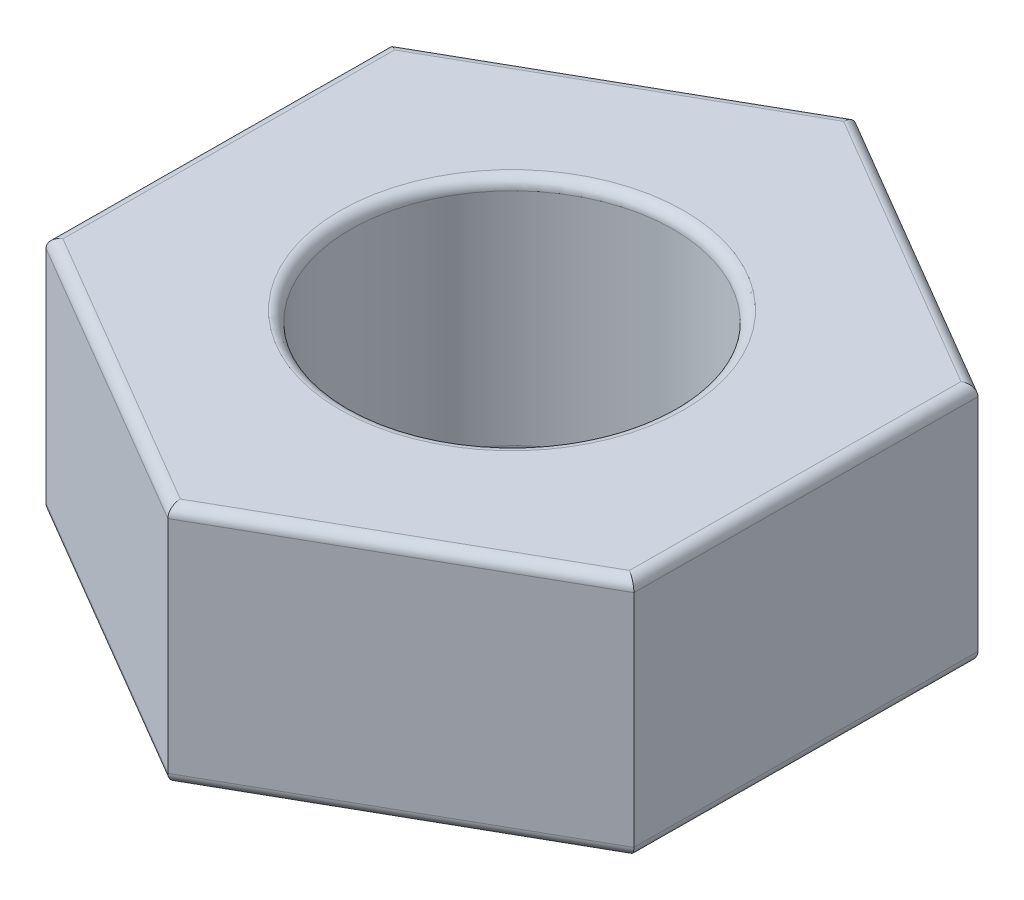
from build123d import *

# Parameters (mm, degrees)
SKETCH1_R           = 1.5
BOSS_EXTRUDE1_DEPTH = 2.25
FILLET1_R           = 0.1


with BuildPart() as part:
    # Sketch1 → Boss-Extrude1 (new body)
    with BuildSketch(Plane(origin=(0, 0, 0), x_dir=(1, 0, 0), z_dir=(0, 1, 0))):
        Polygon((2.739003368, -1.606609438), (2.760866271, 1.568741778), (0.021862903, 3.175351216), (-2.739003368, 1.606609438), (-2.760866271, -1.568741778), (-0.021862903, -3.175351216), align=None)
        with Locations(Location((0, 0, 0), (0, 0, 270))):
            Circle(SKETCH1_R, mode=Mode.SUBTRACT)
    extrude(amount=BOSS_EXTRUDE1_DEPTH)

    # Fillet1
    fillet1_edges = [part.edges().sort_by_distance(p)[0] for p in [
        (1.391364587, 2.25, -2.372046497),
        (-1.358570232, 2.25, -2.390980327),
        (-2.749934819, 2.25, -0.01893383),
        (0, 0, -1.5),
        (0, 2.25, -1.5),
        (-1.391364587, 2.25, 2.372046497),
        (1.358570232, 2.25, 2.390980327),
        (-1.391364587, 0, 2.372046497),
        (-2.749934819, 0, -0.01893383),
        (-1.358570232, 0, -2.390980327),
        (2.749934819, 2.25, 0.01893383),
        (1.391364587, 0, -2.372046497),
        (2.749934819, 0, 0.01893383),
        (1.358570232, 0, 2.390980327),
    ]]
    fillet(fillet1_edges, radius=FILLET1_R)


solid = part.part
